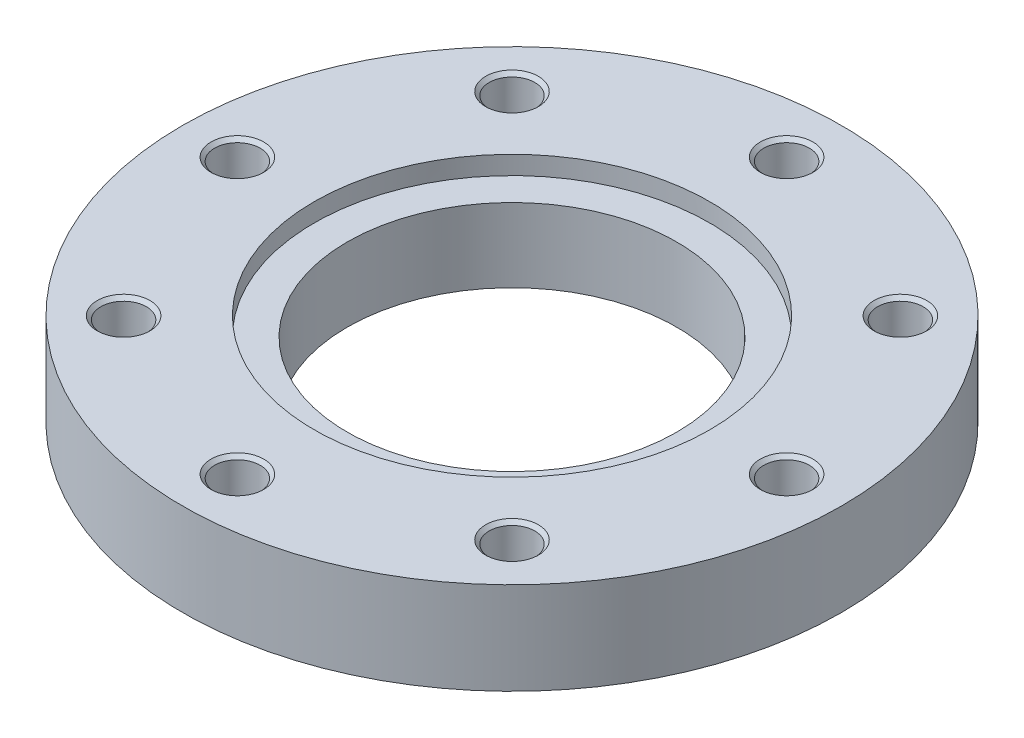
ISO-10303-21;
HEADER;
FILE_DESCRIPTION(('STEP AP214'),'2;1');
FILE_NAME('part.step','',(''),(''),'','','');
FILE_SCHEMA(('AUTOMOTIVE_DESIGN { 1 0 10303 214 1 1 1 1 }'));
ENDSEC;
DATA;
#1=APPLICATION_CONTEXT('core data for automotive mechanical design processes');
#2=APPLICATION_PROTOCOL_DEFINITION('international standard','automotive_design',2000,#1);
#3=PRODUCT_CONTEXT('',#1,'mechanical');
#4=PRODUCT('Part','Part','',(#3));
#5=PRODUCT_RELATED_PRODUCT_CATEGORY('part','',(#4));
#6=PRODUCT_DEFINITION_FORMATION('','',#4);
#7=PRODUCT_DEFINITION_CONTEXT('part definition',#1,'design');
#8=PRODUCT_DEFINITION('design','',#6,#7);
#9=PRODUCT_DEFINITION_SHAPE('','',#8);
#10=(LENGTH_UNIT() NAMED_UNIT(*) SI_UNIT(.MILLI.,.METRE.));
#11=(NAMED_UNIT(*) PLANE_ANGLE_UNIT() SI_UNIT($,.RADIAN.));
#12=(NAMED_UNIT(*) SI_UNIT($,.STERADIAN.) SOLID_ANGLE_UNIT());
#13=UNCERTAINTY_MEASURE_WITH_UNIT(LENGTH_MEASURE(1.E-05),#10,'distance_accuracy_value','');
#14=(GEOMETRIC_REPRESENTATION_CONTEXT(3) GLOBAL_UNCERTAINTY_ASSIGNED_CONTEXT((#13)) GLOBAL_UNIT_ASSIGNED_CONTEXT((#10,
#11,#12)) REPRESENTATION_CONTEXT('',''));
#15=CARTESIAN_POINT('',(0.,0.,0.));
#16=DIRECTION('',(0.,0.,1.));
#17=DIRECTION('',(1.,0.,0.));
#18=AXIS2_PLACEMENT_3D('',#15,#16,#17);
#19=CARTESIAN_POINT('',(0.,21.,0.));
#20=DIRECTION('',(0.,-1.,0.));
#21=DIRECTION('',(1.,0.,0.));
#22=AXIS2_PLACEMENT_3D('',#19,#20,#21);
#23=CYLINDRICAL_SURFACE('',#22,150.);
#24=CARTESIAN_POINT('',(0.,0.,0.));
#25=DIRECTION('',(0.,1.,0.));
#26=DIRECTION('',(1.,0.,0.));
#27=AXIS2_PLACEMENT_3D('',#24,#25,#26);
#28=CIRCLE('',#27,150.);
#29=CARTESIAN_POINT('',(150.,0.,0.));
#30=VERTEX_POINT('',#29);
#31=EDGE_CURVE('E9',#30,#30,#28,.T.);
#32=ORIENTED_EDGE('',*,*,#31,.T.);
#33=EDGE_LOOP('',(#32));
#34=FACE_BOUND('',#33,.T.);
#35=CARTESIAN_POINT('',(0.,42.,0.));
#36=DIRECTION('',(0.,1.,0.));
#37=DIRECTION('',(1.,0.,0.));
#38=AXIS2_PLACEMENT_3D('',#35,#36,#37);
#39=CIRCLE('',#38,150.);
#40=CARTESIAN_POINT('',(150.,42.,0.));
#41=VERTEX_POINT('',#40);
#42=EDGE_CURVE('E205',#41,#41,#39,.T.);
#43=ORIENTED_EDGE('',*,*,#42,.F.);
#44=EDGE_LOOP('',(#43));
#45=FACE_BOUND('',#44,.T.);
#46=ADVANCED_FACE('F15',(#34,#45),#23,.T.);
#47=CARTESIAN_POINT('',(112.5,0.,0.));
#48=DIRECTION('',(0.,-1.,0.));
#49=DIRECTION('',(-1.,0.,0.));
#50=AXIS2_PLACEMENT_3D('',#47,#48,#49);
#51=PLANE('',#50);
#52=CARTESIAN_POINT('',(0.,0.,0.));
#53=DIRECTION('',(0.,1.,0.));
#54=DIRECTION('',(1.,0.,0.));
#55=AXIS2_PLACEMENT_3D('',#52,#53,#54);
#56=CIRCLE('',#55,75.);
#57=CARTESIAN_POINT('',(75.,0.,0.));
#58=VERTEX_POINT('',#57);
#59=EDGE_CURVE('E19',#58,#58,#56,.T.);
#60=ORIENTED_EDGE('',*,*,#59,.T.);
#61=EDGE_LOOP('',(#60));
#62=FACE_BOUND('',#61,.T.);
#63=ORIENTED_EDGE('',*,*,#31,.F.);
#64=EDGE_LOOP('',(#63));
#65=FACE_BOUND('',#64,.T.);
#66=ADVANCED_FACE('F17',(#62,#65),#51,.T.);
#67=CARTESIAN_POINT('',(0.,21.,0.));
#68=DIRECTION('',(0.,-1.,0.));
#69=DIRECTION('',(1.,0.,0.));
#70=AXIS2_PLACEMENT_3D('',#67,#68,#69);
#71=CYLINDRICAL_SURFACE('',#70,75.);
#72=ORIENTED_EDGE('',*,*,#59,.F.);
#73=EDGE_LOOP('',(#72));
#74=FACE_BOUND('',#73,.T.);
#75=CARTESIAN_POINT('',(0.,33.6,0.));
#76=DIRECTION('',(0.,1.,0.));
#77=DIRECTION('',(1.,0.,0.));
#78=AXIS2_PLACEMENT_3D('',#75,#76,#77);
#79=CIRCLE('',#78,75.);
#80=CARTESIAN_POINT('',(-75.,33.6,0.));
#81=VERTEX_POINT('',#80);
#82=EDGE_CURVE('E86',#81,#81,#79,.T.);
#83=ORIENTED_EDGE('',*,*,#82,.T.);
#84=EDGE_LOOP('',(#83));
#85=FACE_BOUND('',#84,.T.);
#86=ADVANCED_FACE('F212',(#74,#85),#71,.F.);
#87=CARTESIAN_POINT('',(112.5,42.,0.));
#88=DIRECTION('',(0.,1.,0.));
#89=DIRECTION('',(1.,0.,0.));
#90=AXIS2_PLACEMENT_3D('',#87,#88,#89);
#91=PLANE('',#90);
#92=ORIENTED_EDGE('',*,*,#42,.T.);
#93=EDGE_LOOP('',(#92));
#94=FACE_BOUND('',#93,.T.);
#95=CARTESIAN_POINT('',(0.,42.,0.));
#96=DIRECTION('',(0.,-1.,0.));
#97=DIRECTION('',(1.,0.,0.));
#98=AXIS2_PLACEMENT_3D('',#95,#96,#97);
#99=CIRCLE('',#98,90.);
#100=CARTESIAN_POINT('',(-90.,42.,0.));
#101=VERTEX_POINT('',#100);
#102=EDGE_CURVE('E181',#101,#101,#99,.T.);
#103=ORIENTED_EDGE('',*,*,#102,.T.);
#104=EDGE_LOOP('',(#103));
#105=FACE_BOUND('',#104,.T.);
#106=CARTESIAN_POINT('',(125.,42.,0.));
#107=DIRECTION('',(0.,-1.,0.));
#108=DIRECTION('',(1.,0.,0.));
#109=AXIS2_PLACEMENT_3D('',#106,#107,#108);
#110=CIRCLE('',#109,12.);
#111=CARTESIAN_POINT('',(137.,42.,0.));
#112=VERTEX_POINT('',#111);
#113=EDGE_CURVE('E195',#112,#112,#110,.T.);
#114=ORIENTED_EDGE('',*,*,#113,.T.);
#115=EDGE_LOOP('',(#114));
#116=FACE_BOUND('',#115,.T.);
#117=CARTESIAN_POINT('',(88.3883476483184,42.,-88.3883476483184));
#118=DIRECTION('',(0.,-1.,0.));
#119=DIRECTION('',(0.707106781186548,0.,-0.707106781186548));
#120=AXIS2_PLACEMENT_3D('',#117,#118,#119);
#121=CIRCLE('',#120,12.);
#122=CARTESIAN_POINT('',(96.873629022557,42.,-96.873629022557));
#123=VERTEX_POINT('',#122);
#124=EDGE_CURVE('E175',#123,#123,#121,.T.);
#125=ORIENTED_EDGE('',*,*,#124,.T.);
#126=EDGE_LOOP('',(#125));
#127=FACE_BOUND('',#126,.T.);
#128=CARTESIAN_POINT('',(0.,42.,-125.));
#129=DIRECTION('',(0.,-1.,0.));
#130=DIRECTION('',(0.,0.,-1.));
#131=AXIS2_PLACEMENT_3D('',#128,#129,#130);
#132=CIRCLE('',#131,12.);
#133=CARTESIAN_POINT('',(0.,42.,-137.));
#134=VERTEX_POINT('',#133);
#135=EDGE_CURVE('E373',#134,#134,#132,.T.);
#136=ORIENTED_EDGE('',*,*,#135,.T.);
#137=EDGE_LOOP('',(#136));
#138=FACE_BOUND('',#137,.T.);
#139=CARTESIAN_POINT('',(-88.3883476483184,42.,-88.3883476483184));
#140=DIRECTION('',(0.,-1.,0.));
#141=DIRECTION('',(-0.707106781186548,0.,-0.707106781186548));
#142=AXIS2_PLACEMENT_3D('',#139,#140,#141);
#143=CIRCLE('',#142,12.);
#144=CARTESIAN_POINT('',(-96.873629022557,42.,-96.873629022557));
#145=VERTEX_POINT('',#144);
#146=EDGE_CURVE('E376',#145,#145,#143,.T.);
#147=ORIENTED_EDGE('',*,*,#146,.T.);
#148=EDGE_LOOP('',(#147));
#149=FACE_BOUND('',#148,.T.);
#150=CARTESIAN_POINT('',(-125.,42.,0.));
#151=DIRECTION('',(0.,-1.,0.));
#152=DIRECTION('',(-1.,0.,0.));
#153=AXIS2_PLACEMENT_3D('',#150,#151,#152);
#154=CIRCLE('',#153,12.);
#155=CARTESIAN_POINT('',(-137.,42.,0.));
#156=VERTEX_POINT('',#155);
#157=EDGE_CURVE('E379',#156,#156,#154,.T.);
#158=ORIENTED_EDGE('',*,*,#157,.T.);
#159=EDGE_LOOP('',(#158));
#160=FACE_BOUND('',#159,.T.);
#161=CARTESIAN_POINT('',(-88.3883476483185,42.,88.3883476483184));
#162=DIRECTION('',(0.,-1.,0.));
#163=DIRECTION('',(-0.707106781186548,0.,0.707106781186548));
#164=AXIS2_PLACEMENT_3D('',#161,#162,#163);
#165=CIRCLE('',#164,12.);
#166=CARTESIAN_POINT('',(-96.873629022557,42.,96.873629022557));
#167=VERTEX_POINT('',#166);
#168=EDGE_CURVE('E384',#167,#167,#165,.T.);
#169=ORIENTED_EDGE('',*,*,#168,.T.);
#170=EDGE_LOOP('',(#169));
#171=FACE_BOUND('',#170,.T.);
#172=CARTESIAN_POINT('',(0.,42.,125.));
#173=DIRECTION('',(0.,-1.,0.));
#174=DIRECTION('',(0.,0.,1.));
#175=AXIS2_PLACEMENT_3D('',#172,#173,#174);
#176=CIRCLE('',#175,12.);
#177=CARTESIAN_POINT('',(0.,42.,137.));
#178=VERTEX_POINT('',#177);
#179=EDGE_CURVE('E389',#178,#178,#176,.T.);
#180=ORIENTED_EDGE('',*,*,#179,.T.);
#181=EDGE_LOOP('',(#180));
#182=FACE_BOUND('',#181,.T.);
#183=CARTESIAN_POINT('',(88.3883476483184,42.,88.3883476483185));
#184=DIRECTION('',(0.,-1.,0.));
#185=DIRECTION('',(0.707106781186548,0.,0.707106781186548));
#186=AXIS2_PLACEMENT_3D('',#183,#184,#185);
#187=CIRCLE('',#186,12.);
#188=CARTESIAN_POINT('',(96.873629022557,42.,96.873629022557));
#189=VERTEX_POINT('',#188);
#190=EDGE_CURVE('E393',#189,#189,#187,.T.);
#191=ORIENTED_EDGE('',*,*,#190,.T.);
#192=EDGE_LOOP('',(#191));
#193=FACE_BOUND('',#192,.T.);
#194=ADVANCED_FACE('F214',(#94,#105,#116,#127,#138,#149,#160,#171,#182,#193),#91,.T.);
#195=CARTESIAN_POINT('',(0.,33.6,0.));
#196=DIRECTION('',(0.,-1.,0.));
#197=DIRECTION('',(-1.,0.,0.));
#198=AXIS2_PLACEMENT_3D('',#195,#196,#197);
#199=PLANE('',#198);
#200=CARTESIAN_POINT('',(0.,33.6,0.));
#201=DIRECTION('',(0.,-1.,0.));
#202=DIRECTION('',(1.,0.,0.));
#203=AXIS2_PLACEMENT_3D('',#200,#201,#202);
#204=CIRCLE('',#203,90.);
#205=CARTESIAN_POINT('',(90.,33.6,0.));
#206=VERTEX_POINT('',#205);
#207=EDGE_CURVE('E81',#206,#206,#204,.T.);
#208=ORIENTED_EDGE('',*,*,#207,.F.);
#209=EDGE_LOOP('',(#208));
#210=FACE_BOUND('',#209,.T.);
#211=ORIENTED_EDGE('',*,*,#82,.F.);
#212=EDGE_LOOP('',(#211));
#213=FACE_BOUND('',#212,.T.);
#214=ADVANCED_FACE('F221',(#210,#213),#199,.F.);
#215=CARTESIAN_POINT('',(0.,39.9,0.));
#216=DIRECTION('',(0.,-1.,0.));
#217=DIRECTION('',(1.,0.,0.));
#218=AXIS2_PLACEMENT_3D('',#215,#216,#217);
#219=CYLINDRICAL_SURFACE('',#218,90.);
#220=ORIENTED_EDGE('',*,*,#207,.T.);
#221=EDGE_LOOP('',(#220));
#222=FACE_BOUND('',#221,.T.);
#223=ORIENTED_EDGE('',*,*,#102,.F.);
#224=EDGE_LOOP('',(#223));
#225=FACE_BOUND('',#224,.T.);
#226=ADVANCED_FACE('F355',(#222,#225),#219,.F.);
#227=CARTESIAN_POINT('',(125.,6.00463463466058,0.));
#228=DIRECTION('',(0.,1.,0.));
#229=DIRECTION('',(1.,0.,0.));
#230=AXIS2_PLACEMENT_3D('',#227,#228,#229);
#231=CONICAL_SURFACE('',#230,5.188125,1.0471975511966);
#232=CARTESIAN_POINT('',(125.,9.,0.));
#233=DIRECTION('',(0.,-1.,0.));
#234=DIRECTION('',(1.,0.,0.));
#235=AXIS2_PLACEMENT_3D('',#232,#233,#234);
#236=CIRCLE('',#235,10.37625);
#237=CARTESIAN_POINT('',(135.37625,9.,0.));
#238=VERTEX_POINT('',#237);
#239=EDGE_CURVE('E183',#238,#238,#236,.T.);
#240=ORIENTED_EDGE('',*,*,#239,.F.);
#241=EDGE_LOOP('',(#240));
#242=FACE_BOUND('',#241,.T.);
#243=CARTESIAN_POINT('',(125.,3.00926926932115,0.));
#244=VERTEX_POINT('',#243);
#245=VERTEX_LOOP('',#244);
#246=FACE_BOUND('',#245,.T.);
#247=ADVANCED_FACE('F351',(#242,#246),#231,.F.);
#248=CARTESIAN_POINT('',(125.,12.688125,0.));
#249=DIRECTION('',(0.,1.,0.));
#250=DIRECTION('',(1.,0.,0.));
#251=AXIS2_PLACEMENT_3D('',#248,#249,#250);
#252=CYLINDRICAL_SURFACE('',#251,10.37625);
#253=CARTESIAN_POINT('',(125.,16.37625,0.));
#254=DIRECTION('',(0.,-1.,0.));
#255=DIRECTION('',(1.,0.,0.));
#256=AXIS2_PLACEMENT_3D('',#253,#254,#255);
#257=CIRCLE('',#256,10.37625);
#258=CARTESIAN_POINT('',(135.37625,16.37625,0.));
#259=VERTEX_POINT('',#258);
#260=EDGE_CURVE('E202',#259,#259,#257,.T.);
#261=ORIENTED_EDGE('',*,*,#260,.F.);
#262=EDGE_LOOP('',(#261));
#263=FACE_BOUND('',#262,.T.);
#264=ORIENTED_EDGE('',*,*,#239,.T.);
#265=EDGE_LOOP('',(#264));
#266=FACE_BOUND('',#265,.T.);
#267=ADVANCED_FACE('F347',(#263,#266),#252,.F.);
#268=CARTESIAN_POINT('',(125.,17.188125,0.));
#269=DIRECTION('',(0.,1.,0.));
#270=DIRECTION('',(1.,0.,0.));
#271=AXIS2_PLACEMENT_3D('',#268,#269,#270);
#272=CONICAL_SURFACE('',#271,11.188125,0.785398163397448);
#273=CARTESIAN_POINT('',(125.,18.,0.));
#274=DIRECTION('',(0.,-1.,0.));
#275=DIRECTION('',(1.,0.,0.));
#276=AXIS2_PLACEMENT_3D('',#273,#274,#275);
#277=CIRCLE('',#276,12.);
#278=CARTESIAN_POINT('',(137.,18.,0.));
#279=VERTEX_POINT('',#278);
#280=EDGE_CURVE('E200',#279,#279,#277,.T.);
#281=ORIENTED_EDGE('',*,*,#280,.F.);
#282=EDGE_LOOP('',(#281));
#283=FACE_BOUND('',#282,.T.);
#284=ORIENTED_EDGE('',*,*,#260,.T.);
#285=EDGE_LOOP('',(#284));
#286=FACE_BOUND('',#285,.T.);
#287=ADVANCED_FACE('F343',(#283,#286),#272,.F.);
#288=CARTESIAN_POINT('',(136.188125,18.,0.));
#289=DIRECTION('',(0.,1.,0.));
#290=DIRECTION('',(-1.,0.,0.));
#291=AXIS2_PLACEMENT_3D('',#288,#289,#290);
#292=PLANE('',#291);
#293=CARTESIAN_POINT('',(125.,18.,0.));
#294=DIRECTION('',(0.,-1.,0.));
#295=DIRECTION('',(1.,0.,0.));
#296=AXIS2_PLACEMENT_3D('',#293,#294,#295);
#297=CIRCLE('',#296,10.37625);
#298=CARTESIAN_POINT('',(135.37625,18.,0.));
#299=VERTEX_POINT('',#298);
#300=EDGE_CURVE('E198',#299,#299,#297,.T.);
#301=ORIENTED_EDGE('',*,*,#300,.F.);
#302=EDGE_LOOP('',(#301));
#303=FACE_BOUND('',#302,.T.);
#304=ORIENTED_EDGE('',*,*,#280,.T.);
#305=EDGE_LOOP('',(#304));
#306=FACE_BOUND('',#305,.T.);
#307=ADVANCED_FACE('F340',(#303,#306),#292,.F.);
#308=CARTESIAN_POINT('',(125.,29.188125,0.));
#309=DIRECTION('',(0.,1.,0.));
#310=DIRECTION('',(1.,0.,0.));
#311=AXIS2_PLACEMENT_3D('',#308,#309,#310);
#312=CYLINDRICAL_SURFACE('',#311,10.37625);
#313=CARTESIAN_POINT('',(125.,40.37625,0.));
#314=DIRECTION('',(0.,-1.,0.));
#315=DIRECTION('',(1.,0.,0.));
#316=AXIS2_PLACEMENT_3D('',#313,#314,#315);
#317=CIRCLE('',#316,10.37625);
#318=CARTESIAN_POINT('',(135.37625,40.37625,0.));
#319=VERTEX_POINT('',#318);
#320=EDGE_CURVE('E193',#319,#319,#317,.T.);
#321=ORIENTED_EDGE('',*,*,#320,.F.);
#322=EDGE_LOOP('',(#321));
#323=FACE_BOUND('',#322,.T.);
#324=ORIENTED_EDGE('',*,*,#300,.T.);
#325=EDGE_LOOP('',(#324));
#326=FACE_BOUND('',#325,.T.);
#327=ADVANCED_FACE('F266',(#323,#326),#312,.F.);
#328=CARTESIAN_POINT('',(125.,41.188125,0.));
#329=DIRECTION('',(0.,1.,0.));
#330=DIRECTION('',(1.,0.,0.));
#331=AXIS2_PLACEMENT_3D('',#328,#329,#330);
#332=CONICAL_SURFACE('',#331,11.188125,0.785398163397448);
#333=ORIENTED_EDGE('',*,*,#113,.F.);
#334=EDGE_LOOP('',(#333));
#335=FACE_BOUND('',#334,.T.);
#336=ORIENTED_EDGE('',*,*,#320,.T.);
#337=EDGE_LOOP('',(#336));
#338=FACE_BOUND('',#337,.T.);
#339=ADVANCED_FACE('F262',(#335,#338),#332,.F.);
#340=CARTESIAN_POINT('',(88.3883476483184,6.00463463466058,-88.3883476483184));
#341=DIRECTION('',(0.,1.,0.));
#342=DIRECTION('',(0.707106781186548,0.,-0.707106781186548));
#343=AXIS2_PLACEMENT_3D('',#340,#341,#342);
#344=CONICAL_SURFACE('',#343,5.188125,1.0471975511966);
#345=CARTESIAN_POINT('',(88.3883476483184,9.,-88.3883476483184));
#346=DIRECTION('',(0.,-1.,0.));
#347=DIRECTION('',(0.707106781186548,0.,-0.707106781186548));
#348=AXIS2_PLACEMENT_3D('',#345,#346,#347);
#349=CIRCLE('',#348,10.37625);
#350=CARTESIAN_POINT('',(95.7254643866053,9.,-95.7254643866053));
#351=VERTEX_POINT('',#350);
#352=EDGE_CURVE('E191',#351,#351,#349,.T.);
#353=ORIENTED_EDGE('',*,*,#352,.F.);
#354=EDGE_LOOP('',(#353));
#355=FACE_BOUND('',#354,.T.);
#356=CARTESIAN_POINT('',(88.3883476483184,3.00926926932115,-88.3883476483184));
#357=VERTEX_POINT('',#356);
#358=VERTEX_LOOP('',#357);
#359=FACE_BOUND('',#358,.T.);
#360=ADVANCED_FACE('F265',(#355,#359),#344,.F.);
#361=CARTESIAN_POINT('',(88.3883476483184,12.688125,-88.3883476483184));
#362=DIRECTION('',(0.,1.,0.));
#363=DIRECTION('',(0.707106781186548,0.,-0.707106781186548));
#364=AXIS2_PLACEMENT_3D('',#361,#362,#363);
#365=CYLINDRICAL_SURFACE('',#364,10.37625);
#366=CARTESIAN_POINT('',(88.3883476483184,16.37625,-88.3883476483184));
#367=DIRECTION('',(0.,-1.,0.));
#368=DIRECTION('',(0.707106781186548,0.,-0.707106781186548));
#369=AXIS2_PLACEMENT_3D('',#366,#367,#368);
#370=CIRCLE('',#369,10.37625);
#371=CARTESIAN_POINT('',(95.7254643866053,16.37625,-95.7254643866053));
#372=VERTEX_POINT('',#371);
#373=EDGE_CURVE('E188',#372,#372,#370,.T.);
#374=ORIENTED_EDGE('',*,*,#373,.F.);
#375=EDGE_LOOP('',(#374));
#376=FACE_BOUND('',#375,.T.);
#377=ORIENTED_EDGE('',*,*,#352,.T.);
#378=EDGE_LOOP('',(#377));
#379=FACE_BOUND('',#378,.T.);
#380=ADVANCED_FACE('F332',(#376,#379),#365,.F.);
#381=CARTESIAN_POINT('',(88.3883476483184,17.188125,-88.3883476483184));
#382=DIRECTION('',(0.,1.,0.));
#383=DIRECTION('',(0.707106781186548,0.,-0.707106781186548));
#384=AXIS2_PLACEMENT_3D('',#381,#382,#383);
#385=CONICAL_SURFACE('',#384,11.188125,0.785398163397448);
#386=CARTESIAN_POINT('',(88.3883476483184,18.,-88.3883476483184));
#387=DIRECTION('',(0.,-1.,0.));
#388=DIRECTION('',(0.707106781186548,0.,-0.707106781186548));
#389=AXIS2_PLACEMENT_3D('',#386,#387,#388);
#390=CIRCLE('',#389,12.);
#391=CARTESIAN_POINT('',(96.873629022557,18.,-96.873629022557));
#392=VERTEX_POINT('',#391);
#393=EDGE_CURVE('E186',#392,#392,#390,.T.);
#394=ORIENTED_EDGE('',*,*,#393,.F.);
#395=EDGE_LOOP('',(#394));
#396=FACE_BOUND('',#395,.T.);
#397=ORIENTED_EDGE('',*,*,#373,.T.);
#398=EDGE_LOOP('',(#397));
#399=FACE_BOUND('',#398,.T.);
#400=ADVANCED_FACE('F328',(#396,#399),#385,.F.);
#401=CARTESIAN_POINT('',(96.2995467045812,18.,-96.2995467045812));
#402=DIRECTION('',(0.,1.,0.));
#403=DIRECTION('',(-0.707106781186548,0.,0.707106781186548));
#404=AXIS2_PLACEMENT_3D('',#401,#402,#403);
#405=PLANE('',#404);
#406=CARTESIAN_POINT('',(88.3883476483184,18.,-88.3883476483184));
#407=DIRECTION('',(0.,-1.,0.));
#408=DIRECTION('',(0.707106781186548,0.,-0.707106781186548));
#409=AXIS2_PLACEMENT_3D('',#406,#407,#408);
#410=CIRCLE('',#409,10.37625);
#411=CARTESIAN_POINT('',(95.7254643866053,18.,-95.7254643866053));
#412=VERTEX_POINT('',#411);
#413=EDGE_CURVE('E185',#412,#412,#410,.T.);
#414=ORIENTED_EDGE('',*,*,#413,.F.);
#415=EDGE_LOOP('',(#414));
#416=FACE_BOUND('',#415,.T.);
#417=ORIENTED_EDGE('',*,*,#393,.T.);
#418=EDGE_LOOP('',(#417));
#419=FACE_BOUND('',#418,.T.);
#420=ADVANCED_FACE('F324',(#416,#419),#405,.F.);
#421=CARTESIAN_POINT('',(88.3883476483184,29.188125,-88.3883476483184));
#422=DIRECTION('',(0.,1.,0.));
#423=DIRECTION('',(0.707106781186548,0.,-0.707106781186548));
#424=AXIS2_PLACEMENT_3D('',#421,#422,#423);
#425=CYLINDRICAL_SURFACE('',#424,10.37625);
#426=CARTESIAN_POINT('',(88.3883476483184,40.37625,-88.3883476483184));
#427=DIRECTION('',(0.,-1.,0.));
#428=DIRECTION('',(0.707106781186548,0.,-0.707106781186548));
#429=AXIS2_PLACEMENT_3D('',#426,#427,#428);
#430=CIRCLE('',#429,10.37625);
#431=CARTESIAN_POINT('',(95.7254643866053,40.37625,-95.7254643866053));
#432=VERTEX_POINT('',#431);
#433=EDGE_CURVE('E173',#432,#432,#430,.T.);
#434=ORIENTED_EDGE('',*,*,#433,.F.);
#435=EDGE_LOOP('',(#434));
#436=FACE_BOUND('',#435,.T.);
#437=ORIENTED_EDGE('',*,*,#413,.T.);
#438=EDGE_LOOP('',(#437));
#439=FACE_BOUND('',#438,.T.);
#440=ADVANCED_FACE('F320',(#436,#439),#425,.F.);
#441=CARTESIAN_POINT('',(88.3883476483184,41.188125,-88.3883476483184));
#442=DIRECTION('',(0.,1.,0.));
#443=DIRECTION('',(0.707106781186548,0.,-0.707106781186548));
#444=AXIS2_PLACEMENT_3D('',#441,#442,#443);
#445=CONICAL_SURFACE('',#444,11.188125,0.785398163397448);
#446=ORIENTED_EDGE('',*,*,#124,.F.);
#447=EDGE_LOOP('',(#446));
#448=FACE_BOUND('',#447,.T.);
#449=ORIENTED_EDGE('',*,*,#433,.T.);
#450=EDGE_LOOP('',(#449));
#451=FACE_BOUND('',#450,.T.);
#452=ADVANCED_FACE('F317',(#448,#451),#445,.F.);
#453=CARTESIAN_POINT('',(0.,6.00463463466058,-125.));
#454=DIRECTION('',(0.,1.,0.));
#455=DIRECTION('',(0.,0.,-1.));
#456=AXIS2_PLACEMENT_3D('',#453,#454,#455);
#457=CONICAL_SURFACE('',#456,5.188125,1.0471975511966);
#458=CARTESIAN_POINT('',(0.,9.,-125.));
#459=DIRECTION('',(0.,-1.,0.));
#460=DIRECTION('',(0.,0.,-1.));
#461=AXIS2_PLACEMENT_3D('',#458,#459,#460);
#462=CIRCLE('',#461,10.37625);
#463=CARTESIAN_POINT('',(0.,9.,-135.37625));
#464=VERTEX_POINT('',#463);
#465=EDGE_CURVE('E170',#464,#464,#462,.T.);
#466=ORIENTED_EDGE('',*,*,#465,.F.);
#467=EDGE_LOOP('',(#466));
#468=FACE_BOUND('',#467,.T.);
#469=CARTESIAN_POINT('',(0.,3.00926926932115,-125.));
#470=VERTEX_POINT('',#469);
#471=VERTEX_LOOP('',#470);
#472=FACE_BOUND('',#471,.T.);
#473=ADVANCED_FACE('F313',(#468,#472),#457,.F.);
#474=CARTESIAN_POINT('',(0.,12.688125,-125.));
#475=DIRECTION('',(0.,1.,0.));
#476=DIRECTION('',(0.,0.,-1.));
#477=AXIS2_PLACEMENT_3D('',#474,#475,#476);
#478=CYLINDRICAL_SURFACE('',#477,10.37625);
#479=CARTESIAN_POINT('',(0.,16.37625,-125.));
#480=DIRECTION('',(0.,-1.,0.));
#481=DIRECTION('',(0.,0.,-1.));
#482=AXIS2_PLACEMENT_3D('',#479,#480,#481);
#483=CIRCLE('',#482,10.37625);
#484=CARTESIAN_POINT('',(0.,16.37625,-135.37625));
#485=VERTEX_POINT('',#484);
#486=EDGE_CURVE('E166',#485,#485,#483,.T.);
#487=ORIENTED_EDGE('',*,*,#486,.F.);
#488=EDGE_LOOP('',(#487));
#489=FACE_BOUND('',#488,.T.);
#490=ORIENTED_EDGE('',*,*,#465,.T.);
#491=EDGE_LOOP('',(#490));
#492=FACE_BOUND('',#491,.T.);
#493=ADVANCED_FACE('F171',(#489,#492),#478,.F.);
#494=CARTESIAN_POINT('',(0.,17.188125,-125.));
#495=DIRECTION('',(0.,1.,0.));
#496=DIRECTION('',(0.,0.,-1.));
#497=AXIS2_PLACEMENT_3D('',#494,#495,#496);
#498=CONICAL_SURFACE('',#497,11.188125,0.785398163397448);
#499=CARTESIAN_POINT('',(0.,18.,-125.));
#500=DIRECTION('',(0.,-1.,0.));
#501=DIRECTION('',(0.,0.,-1.));
#502=AXIS2_PLACEMENT_3D('',#499,#500,#501);
#503=CIRCLE('',#502,12.);
#504=CARTESIAN_POINT('',(0.,18.,-137.));
#505=VERTEX_POINT('',#504);
#506=EDGE_CURVE('E177',#505,#505,#503,.T.);
#507=ORIENTED_EDGE('',*,*,#506,.F.);
#508=EDGE_LOOP('',(#507));
#509=FACE_BOUND('',#508,.T.);
#510=ORIENTED_EDGE('',*,*,#486,.T.);
#511=EDGE_LOOP('',(#510));
#512=FACE_BOUND('',#511,.T.);
#513=ADVANCED_FACE('F306',(#509,#512),#498,.F.);
#514=CARTESIAN_POINT('',(0.,18.,-136.188125));
#515=DIRECTION('',(0.,1.,0.));
#516=DIRECTION('',(0.,0.,1.));
#517=AXIS2_PLACEMENT_3D('',#514,#515,#516);
#518=PLANE('',#517);
#519=CARTESIAN_POINT('',(0.,18.,-125.));
#520=DIRECTION('',(0.,-1.,0.));
#521=DIRECTION('',(0.,0.,-1.));
#522=AXIS2_PLACEMENT_3D('',#519,#520,#521);
#523=CIRCLE('',#522,10.37625);
#524=CARTESIAN_POINT('',(0.,18.,-135.37625));
#525=VERTEX_POINT('',#524);
#526=EDGE_CURVE('E467',#525,#525,#523,.T.);
#527=ORIENTED_EDGE('',*,*,#526,.F.);
#528=EDGE_LOOP('',(#527));
#529=FACE_BOUND('',#528,.T.);
#530=ORIENTED_EDGE('',*,*,#506,.T.);
#531=EDGE_LOOP('',(#530));
#532=FACE_BOUND('',#531,.T.);
#533=ADVANCED_FACE('F302',(#529,#532),#518,.F.);
#534=CARTESIAN_POINT('',(0.,29.188125,-125.));
#535=DIRECTION('',(0.,1.,0.));
#536=DIRECTION('',(0.,0.,-1.));
#537=AXIS2_PLACEMENT_3D('',#534,#535,#536);
#538=CYLINDRICAL_SURFACE('',#537,10.37625);
#539=CARTESIAN_POINT('',(0.,40.37625,-125.));
#540=DIRECTION('',(0.,-1.,0.));
#541=DIRECTION('',(0.,0.,-1.));
#542=AXIS2_PLACEMENT_3D('',#539,#540,#541);
#543=CIRCLE('',#542,10.37625);
#544=CARTESIAN_POINT('',(0.,40.37625,-135.37625));
#545=VERTEX_POINT('',#544);
#546=EDGE_CURVE('E464',#545,#545,#543,.T.);
#547=ORIENTED_EDGE('',*,*,#546,.F.);
#548=EDGE_LOOP('',(#547));
#549=FACE_BOUND('',#548,.T.);
#550=ORIENTED_EDGE('',*,*,#526,.T.);
#551=EDGE_LOOP('',(#550));
#552=FACE_BOUND('',#551,.T.);
#553=ADVANCED_FACE('F298',(#549,#552),#538,.F.);
#554=CARTESIAN_POINT('',(0.,41.188125,-125.));
#555=DIRECTION('',(0.,1.,0.));
#556=DIRECTION('',(0.,0.,-1.));
#557=AXIS2_PLACEMENT_3D('',#554,#555,#556);
#558=CONICAL_SURFACE('',#557,11.188125,0.785398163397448);
#559=ORIENTED_EDGE('',*,*,#135,.F.);
#560=EDGE_LOOP('',(#559));
#561=FACE_BOUND('',#560,.T.);
#562=ORIENTED_EDGE('',*,*,#546,.T.);
#563=EDGE_LOOP('',(#562));
#564=FACE_BOUND('',#563,.T.);
#565=ADVANCED_FACE('F294',(#561,#564),#558,.F.);
#566=CARTESIAN_POINT('',(-88.3883476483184,6.00463463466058,-88.3883476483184));
#567=DIRECTION('',(0.,1.,0.));
#568=DIRECTION('',(-0.707106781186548,0.,-0.707106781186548));
#569=AXIS2_PLACEMENT_3D('',#566,#567,#568);
#570=CONICAL_SURFACE('',#569,5.188125,1.0471975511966);
#571=CARTESIAN_POINT('',(-88.3883476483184,9.,-88.3883476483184));
#572=DIRECTION('',(0.,-1.,0.));
#573=DIRECTION('',(-0.707106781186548,0.,-0.707106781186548));
#574=AXIS2_PLACEMENT_3D('',#571,#572,#573);
#575=CIRCLE('',#574,10.37625);
#576=CARTESIAN_POINT('',(-95.7254643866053,9.,-95.7254643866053));
#577=VERTEX_POINT('',#576);
#578=EDGE_CURVE('E407',#577,#577,#575,.T.);
#579=ORIENTED_EDGE('',*,*,#578,.F.);
#580=EDGE_LOOP('',(#579));
#581=FACE_BOUND('',#580,.T.);
#582=CARTESIAN_POINT('',(-88.3883476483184,3.00926926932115,-88.3883476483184));
#583=VERTEX_POINT('',#582);
#584=VERTEX_LOOP('',#583);
#585=FACE_BOUND('',#584,.T.);
#586=ADVANCED_FACE('F290',(#581,#585),#570,.F.);
#587=CARTESIAN_POINT('',(-88.3883476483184,12.688125,-88.3883476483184));
#588=DIRECTION('',(0.,1.,0.));
#589=DIRECTION('',(-0.707106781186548,0.,-0.707106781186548));
#590=AXIS2_PLACEMENT_3D('',#587,#588,#589);
#591=CYLINDRICAL_SURFACE('',#590,10.37625);
#592=CARTESIAN_POINT('',(-88.3883476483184,16.37625,-88.3883476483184));
#593=DIRECTION('',(0.,-1.,0.));
#594=DIRECTION('',(-0.707106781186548,0.,-0.707106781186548));
#595=AXIS2_PLACEMENT_3D('',#592,#593,#594);
#596=CIRCLE('',#595,10.37625);
#597=CARTESIAN_POINT('',(-95.7254643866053,16.37625,-95.7254643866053));
#598=VERTEX_POINT('',#597);
#599=EDGE_CURVE('E462',#598,#598,#596,.T.);
#600=ORIENTED_EDGE('',*,*,#599,.F.);
#601=EDGE_LOOP('',(#600));
#602=FACE_BOUND('',#601,.T.);
#603=ORIENTED_EDGE('',*,*,#578,.T.);
#604=EDGE_LOOP('',(#603));
#605=FACE_BOUND('',#604,.T.);
#606=ADVANCED_FACE('F286',(#602,#605),#591,.F.);
#607=CARTESIAN_POINT('',(-88.3883476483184,17.188125,-88.3883476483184));
#608=DIRECTION('',(0.,1.,0.));
#609=DIRECTION('',(-0.707106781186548,0.,-0.707106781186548));
#610=AXIS2_PLACEMENT_3D('',#607,#608,#609);
#611=CONICAL_SURFACE('',#610,11.188125,0.785398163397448);
#612=CARTESIAN_POINT('',(-88.3883476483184,18.,-88.3883476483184));
#613=DIRECTION('',(0.,-1.,0.));
#614=DIRECTION('',(-0.707106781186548,0.,-0.707106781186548));
#615=AXIS2_PLACEMENT_3D('',#612,#613,#614);
#616=CIRCLE('',#615,12.);
#617=CARTESIAN_POINT('',(-96.873629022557,18.,-96.873629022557));
#618=VERTEX_POINT('',#617);
#619=EDGE_CURVE('E460',#618,#618,#616,.T.);
#620=ORIENTED_EDGE('',*,*,#619,.F.);
#621=EDGE_LOOP('',(#620));
#622=FACE_BOUND('',#621,.T.);
#623=ORIENTED_EDGE('',*,*,#599,.T.);
#624=EDGE_LOOP('',(#623));
#625=FACE_BOUND('',#624,.T.);
#626=ADVANCED_FACE('F282',(#622,#625),#611,.F.);
#627=CARTESIAN_POINT('',(-96.2995467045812,18.,-96.2995467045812));
#628=DIRECTION('',(0.,1.,0.));
#629=DIRECTION('',(0.707106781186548,0.,0.707106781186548));
#630=AXIS2_PLACEMENT_3D('',#627,#628,#629);
#631=PLANE('',#630);
#632=CARTESIAN_POINT('',(-88.3883476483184,18.,-88.3883476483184));
#633=DIRECTION('',(0.,-1.,0.));
#634=DIRECTION('',(-0.707106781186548,0.,-0.707106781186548));
#635=AXIS2_PLACEMENT_3D('',#632,#633,#634);
#636=CIRCLE('',#635,10.37625);
#637=CARTESIAN_POINT('',(-95.7254643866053,18.,-95.7254643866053));
#638=VERTEX_POINT('',#637);
#639=EDGE_CURVE('E458',#638,#638,#636,.T.);
#640=ORIENTED_EDGE('',*,*,#639,.F.);
#641=EDGE_LOOP('',(#640));
#642=FACE_BOUND('',#641,.T.);
#643=ORIENTED_EDGE('',*,*,#619,.T.);
#644=EDGE_LOOP('',(#643));
#645=FACE_BOUND('',#644,.T.);
#646=ADVANCED_FACE('F278',(#642,#645),#631,.F.);
#647=CARTESIAN_POINT('',(-88.3883476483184,29.188125,-88.3883476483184));
#648=DIRECTION('',(0.,1.,0.));
#649=DIRECTION('',(-0.707106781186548,0.,-0.707106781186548));
#650=AXIS2_PLACEMENT_3D('',#647,#648,#649);
#651=CYLINDRICAL_SURFACE('',#650,10.37625);
#652=CARTESIAN_POINT('',(-88.3883476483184,40.37625,-88.3883476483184));
#653=DIRECTION('',(0.,-1.,0.));
#654=DIRECTION('',(-0.707106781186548,0.,-0.707106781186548));
#655=AXIS2_PLACEMENT_3D('',#652,#653,#654);
#656=CIRCLE('',#655,10.37625);
#657=CARTESIAN_POINT('',(-95.7254643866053,40.37625,-95.7254643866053));
#658=VERTEX_POINT('',#657);
#659=EDGE_CURVE('E455',#658,#658,#656,.T.);
#660=ORIENTED_EDGE('',*,*,#659,.F.);
#661=EDGE_LOOP('',(#660));
#662=FACE_BOUND('',#661,.T.);
#663=ORIENTED_EDGE('',*,*,#639,.T.);
#664=EDGE_LOOP('',(#663));
#665=FACE_BOUND('',#664,.T.);
#666=ADVANCED_FACE('F274',(#662,#665),#651,.F.);
#667=CARTESIAN_POINT('',(-88.3883476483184,41.188125,-88.3883476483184));
#668=DIRECTION('',(0.,1.,0.));
#669=DIRECTION('',(-0.707106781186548,0.,-0.707106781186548));
#670=AXIS2_PLACEMENT_3D('',#667,#668,#669);
#671=CONICAL_SURFACE('',#670,11.188125,0.785398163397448);
#672=ORIENTED_EDGE('',*,*,#146,.F.);
#673=EDGE_LOOP('',(#672));
#674=FACE_BOUND('',#673,.T.);
#675=ORIENTED_EDGE('',*,*,#659,.T.);
#676=EDGE_LOOP('',(#675));
#677=FACE_BOUND('',#676,.T.);
#678=ADVANCED_FACE('F270',(#674,#677),#671,.F.);
#679=CARTESIAN_POINT('',(-125.,6.00463463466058,0.));
#680=DIRECTION('',(0.,1.,0.));
#681=DIRECTION('',(-1.,0.,0.));
#682=AXIS2_PLACEMENT_3D('',#679,#680,#681);
#683=CONICAL_SURFACE('',#682,5.188125,1.0471975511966);
#684=CARTESIAN_POINT('',(-125.,9.,0.));
#685=DIRECTION('',(0.,-1.,0.));
#686=DIRECTION('',(-1.,0.,0.));
#687=AXIS2_PLACEMENT_3D('',#684,#685,#686);
#688=CIRCLE('',#687,10.37625);
#689=CARTESIAN_POINT('',(-135.37625,9.,0.));
#690=VERTEX_POINT('',#689);
#691=EDGE_CURVE('E453',#690,#690,#688,.T.);
#692=ORIENTED_EDGE('',*,*,#691,.F.);
#693=EDGE_LOOP('',(#692));
#694=FACE_BOUND('',#693,.T.);
#695=CARTESIAN_POINT('',(-125.,3.00926926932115,0.));
#696=VERTEX_POINT('',#695);
#697=VERTEX_LOOP('',#696);
#698=FACE_BOUND('',#697,.T.);
#699=ADVANCED_FACE('F260',(#694,#698),#683,.F.);
#700=CARTESIAN_POINT('',(-125.,12.688125,0.));
#701=DIRECTION('',(0.,1.,0.));
#702=DIRECTION('',(-1.,0.,0.));
#703=AXIS2_PLACEMENT_3D('',#700,#701,#702);
#704=CYLINDRICAL_SURFACE('',#703,10.37625);
#705=CARTESIAN_POINT('',(-125.,16.37625,0.));
#706=DIRECTION('',(0.,-1.,0.));
#707=DIRECTION('',(-1.,0.,0.));
#708=AXIS2_PLACEMENT_3D('',#705,#706,#707);
#709=CIRCLE('',#708,10.37625);
#710=CARTESIAN_POINT('',(-135.37625,16.37625,0.));
#711=VERTEX_POINT('',#710);
#712=EDGE_CURVE('E451',#711,#711,#709,.T.);
#713=ORIENTED_EDGE('',*,*,#712,.F.);
#714=EDGE_LOOP('',(#713));
#715=FACE_BOUND('',#714,.T.);
#716=ORIENTED_EDGE('',*,*,#691,.T.);
#717=EDGE_LOOP('',(#716));
#718=FACE_BOUND('',#717,.T.);
#719=ADVANCED_FACE('F256',(#715,#718),#704,.F.);
#720=CARTESIAN_POINT('',(-125.,17.188125,0.));
#721=DIRECTION('',(0.,1.,0.));
#722=DIRECTION('',(-1.,0.,0.));
#723=AXIS2_PLACEMENT_3D('',#720,#721,#722);
#724=CONICAL_SURFACE('',#723,11.188125,0.785398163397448);
#725=CARTESIAN_POINT('',(-125.,18.,0.));
#726=DIRECTION('',(0.,-1.,0.));
#727=DIRECTION('',(-1.,0.,0.));
#728=AXIS2_PLACEMENT_3D('',#725,#726,#727);
#729=CIRCLE('',#728,12.);
#730=CARTESIAN_POINT('',(-137.,18.,0.));
#731=VERTEX_POINT('',#730);
#732=EDGE_CURVE('E449',#731,#731,#729,.T.);
#733=ORIENTED_EDGE('',*,*,#732,.F.);
#734=EDGE_LOOP('',(#733));
#735=FACE_BOUND('',#734,.T.);
#736=ORIENTED_EDGE('',*,*,#712,.T.);
#737=EDGE_LOOP('',(#736));
#738=FACE_BOUND('',#737,.T.);
#739=ADVANCED_FACE('F252',(#735,#738),#724,.F.);
#740=CARTESIAN_POINT('',(-136.188125,18.,0.));
#741=DIRECTION('',(0.,1.,0.));
#742=DIRECTION('',(1.,0.,0.));
#743=AXIS2_PLACEMENT_3D('',#740,#741,#742);
#744=PLANE('',#743);
#745=CARTESIAN_POINT('',(-125.,18.,0.));
#746=DIRECTION('',(0.,-1.,0.));
#747=DIRECTION('',(-1.,0.,0.));
#748=AXIS2_PLACEMENT_3D('',#745,#746,#747);
#749=CIRCLE('',#748,10.37625);
#750=CARTESIAN_POINT('',(-135.37625,18.,0.));
#751=VERTEX_POINT('',#750);
#752=EDGE_CURVE('E447',#751,#751,#749,.T.);
#753=ORIENTED_EDGE('',*,*,#752,.F.);
#754=EDGE_LOOP('',(#753));
#755=FACE_BOUND('',#754,.T.);
#756=ORIENTED_EDGE('',*,*,#732,.T.);
#757=EDGE_LOOP('',(#756));
#758=FACE_BOUND('',#757,.T.);
#759=ADVANCED_FACE('F248',(#755,#758),#744,.F.);
#760=CARTESIAN_POINT('',(-125.,29.188125,0.));
#761=DIRECTION('',(0.,1.,0.));
#762=DIRECTION('',(-1.,0.,0.));
#763=AXIS2_PLACEMENT_3D('',#760,#761,#762);
#764=CYLINDRICAL_SURFACE('',#763,10.37625);
#765=CARTESIAN_POINT('',(-125.,40.37625,0.));
#766=DIRECTION('',(0.,-1.,0.));
#767=DIRECTION('',(-1.,0.,0.));
#768=AXIS2_PLACEMENT_3D('',#765,#766,#767);
#769=CIRCLE('',#768,10.37625);
#770=CARTESIAN_POINT('',(-135.37625,40.37625,0.));
#771=VERTEX_POINT('',#770);
#772=EDGE_CURVE('E444',#771,#771,#769,.T.);
#773=ORIENTED_EDGE('',*,*,#772,.F.);
#774=EDGE_LOOP('',(#773));
#775=FACE_BOUND('',#774,.T.);
#776=ORIENTED_EDGE('',*,*,#752,.T.);
#777=EDGE_LOOP('',(#776));
#778=FACE_BOUND('',#777,.T.);
#779=ADVANCED_FACE('F244',(#775,#778),#764,.F.);
#780=CARTESIAN_POINT('',(-125.,41.188125,0.));
#781=DIRECTION('',(0.,1.,0.));
#782=DIRECTION('',(-1.,0.,0.));
#783=AXIS2_PLACEMENT_3D('',#780,#781,#782);
#784=CONICAL_SURFACE('',#783,11.188125,0.785398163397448);
#785=ORIENTED_EDGE('',*,*,#157,.F.);
#786=EDGE_LOOP('',(#785));
#787=FACE_BOUND('',#786,.T.);
#788=ORIENTED_EDGE('',*,*,#772,.T.);
#789=EDGE_LOOP('',(#788));
#790=FACE_BOUND('',#789,.T.);
#791=ADVANCED_FACE('F240',(#787,#790),#784,.F.);
#792=CARTESIAN_POINT('',(-88.3883476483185,6.00463463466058,88.3883476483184));
#793=DIRECTION('',(0.,1.,0.));
#794=DIRECTION('',(-0.707106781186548,0.,0.707106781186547));
#795=AXIS2_PLACEMENT_3D('',#792,#793,#794);
#796=CONICAL_SURFACE('',#795,5.188125,1.0471975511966);
#797=CARTESIAN_POINT('',(-88.3883476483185,9.,88.3883476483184));
#798=DIRECTION('',(0.,-1.,0.));
#799=DIRECTION('',(-0.707106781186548,0.,0.707106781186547));
#800=AXIS2_PLACEMENT_3D('',#797,#798,#799);
#801=CIRCLE('',#800,10.37625);
#802=CARTESIAN_POINT('',(-95.7254643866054,9.,95.7254643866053));
#803=VERTEX_POINT('',#802);
#804=EDGE_CURVE('E442',#803,#803,#801,.T.);
#805=ORIENTED_EDGE('',*,*,#804,.F.);
#806=EDGE_LOOP('',(#805));
#807=FACE_BOUND('',#806,.T.);
#808=CARTESIAN_POINT('',(-88.3883476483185,3.00926926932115,88.3883476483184));
#809=VERTEX_POINT('',#808);
#810=VERTEX_LOOP('',#809);
#811=FACE_BOUND('',#810,.T.);
#812=ADVANCED_FACE('F236',(#807,#811),#796,.F.);
#813=CARTESIAN_POINT('',(-88.3883476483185,12.688125,88.3883476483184));
#814=DIRECTION('',(0.,1.,0.));
#815=DIRECTION('',(-0.707106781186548,0.,0.707106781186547));
#816=AXIS2_PLACEMENT_3D('',#813,#814,#815);
#817=CYLINDRICAL_SURFACE('',#816,10.37625);
#818=CARTESIAN_POINT('',(-88.3883476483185,16.37625,88.3883476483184));
#819=DIRECTION('',(0.,-1.,0.));
#820=DIRECTION('',(-0.707106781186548,0.,0.707106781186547));
#821=AXIS2_PLACEMENT_3D('',#818,#819,#820);
#822=CIRCLE('',#821,10.37625);
#823=CARTESIAN_POINT('',(-95.7254643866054,16.37625,95.7254643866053));
#824=VERTEX_POINT('',#823);
#825=EDGE_CURVE('E439',#824,#824,#822,.T.);
#826=ORIENTED_EDGE('',*,*,#825,.F.);
#827=EDGE_LOOP('',(#826));
#828=FACE_BOUND('',#827,.T.);
#829=ORIENTED_EDGE('',*,*,#804,.T.);
#830=EDGE_LOOP('',(#829));
#831=FACE_BOUND('',#830,.T.);
#832=ADVANCED_FACE('F233',(#828,#831),#817,.F.);
#833=CARTESIAN_POINT('',(-88.3883476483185,17.188125,88.3883476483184));
#834=DIRECTION('',(0.,1.,0.));
#835=DIRECTION('',(-0.707106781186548,0.,0.707106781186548));
#836=AXIS2_PLACEMENT_3D('',#833,#834,#835);
#837=CONICAL_SURFACE('',#836,11.188125,0.785398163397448);
#838=CARTESIAN_POINT('',(-88.3883476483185,18.,88.3883476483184));
#839=DIRECTION('',(0.,-1.,0.));
#840=DIRECTION('',(-0.707106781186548,0.,0.707106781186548));
#841=AXIS2_PLACEMENT_3D('',#838,#839,#840);
#842=CIRCLE('',#841,12.);
#843=CARTESIAN_POINT('',(-96.873629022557,18.,96.873629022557));
#844=VERTEX_POINT('',#843);
#845=EDGE_CURVE('E438',#844,#844,#842,.T.);
#846=ORIENTED_EDGE('',*,*,#845,.F.);
#847=EDGE_LOOP('',(#846));
#848=FACE_BOUND('',#847,.T.);
#849=ORIENTED_EDGE('',*,*,#825,.T.);
#850=EDGE_LOOP('',(#849));
#851=FACE_BOUND('',#850,.T.);
#852=ADVANCED_FACE('F231',(#848,#851),#837,.F.);
#853=CARTESIAN_POINT('',(-96.2995467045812,18.,96.2995467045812));
#854=DIRECTION('',(0.,1.,0.));
#855=DIRECTION('',(0.707106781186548,0.,-0.707106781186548));
#856=AXIS2_PLACEMENT_3D('',#853,#854,#855);
#857=PLANE('',#856);
#858=CARTESIAN_POINT('',(-88.3883476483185,18.,88.3883476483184));
#859=DIRECTION('',(0.,-1.,0.));
#860=DIRECTION('',(-0.707106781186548,0.,0.707106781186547));
#861=AXIS2_PLACEMENT_3D('',#858,#859,#860);
#862=CIRCLE('',#861,10.37625);
#863=CARTESIAN_POINT('',(-95.7254643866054,18.,95.7254643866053));
#864=VERTEX_POINT('',#863);
#865=EDGE_CURVE('E409',#864,#864,#862,.T.);
#866=ORIENTED_EDGE('',*,*,#865,.F.);
#867=EDGE_LOOP('',(#866));
#868=FACE_BOUND('',#867,.T.);
#869=ORIENTED_EDGE('',*,*,#845,.T.);
#870=EDGE_LOOP('',(#869));
#871=FACE_BOUND('',#870,.T.);
#872=ADVANCED_FACE('F503',(#868,#871),#857,.F.);
#873=CARTESIAN_POINT('',(-88.3883476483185,29.188125,88.3883476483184));
#874=DIRECTION('',(0.,1.,0.));
#875=DIRECTION('',(-0.707106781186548,0.,0.707106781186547));
#876=AXIS2_PLACEMENT_3D('',#873,#874,#875);
#877=CYLINDRICAL_SURFACE('',#876,10.37625);
#878=CARTESIAN_POINT('',(-88.3883476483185,40.37625,88.3883476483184));
#879=DIRECTION('',(0.,-1.,0.));
#880=DIRECTION('',(-0.707106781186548,0.,0.707106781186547));
#881=AXIS2_PLACEMENT_3D('',#878,#879,#880);
#882=CIRCLE('',#881,10.37625);
#883=CARTESIAN_POINT('',(-95.7254643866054,40.37625,95.7254643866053));
#884=VERTEX_POINT('',#883);
#885=EDGE_CURVE('E410',#884,#884,#882,.T.);
#886=ORIENTED_EDGE('',*,*,#885,.F.);
#887=EDGE_LOOP('',(#886));
#888=FACE_BOUND('',#887,.T.);
#889=ORIENTED_EDGE('',*,*,#865,.T.);
#890=EDGE_LOOP('',(#889));
#891=FACE_BOUND('',#890,.T.);
#892=ADVANCED_FACE('F508',(#888,#891),#877,.F.);
#893=CARTESIAN_POINT('',(-88.3883476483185,41.188125,88.3883476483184));
#894=DIRECTION('',(0.,1.,0.));
#895=DIRECTION('',(-0.707106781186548,0.,0.707106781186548));
#896=AXIS2_PLACEMENT_3D('',#893,#894,#895);
#897=CONICAL_SURFACE('',#896,11.188125,0.785398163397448);
#898=ORIENTED_EDGE('',*,*,#168,.F.);
#899=EDGE_LOOP('',(#898));
#900=FACE_BOUND('',#899,.T.);
#901=ORIENTED_EDGE('',*,*,#885,.T.);
#902=EDGE_LOOP('',(#901));
#903=FACE_BOUND('',#902,.T.);
#904=ADVANCED_FACE('F515',(#900,#903),#897,.F.);
#905=CARTESIAN_POINT('',(0.,6.00463463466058,125.));
#906=DIRECTION('',(0.,1.,0.));
#907=DIRECTION('',(0.,0.,1.));
#908=AXIS2_PLACEMENT_3D('',#905,#906,#907);
#909=CONICAL_SURFACE('',#908,5.188125,1.0471975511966);
#910=CARTESIAN_POINT('',(0.,9.,125.));
#911=DIRECTION('',(0.,-1.,0.));
#912=DIRECTION('',(0.,0.,1.));
#913=AXIS2_PLACEMENT_3D('',#910,#911,#912);
#914=CIRCLE('',#913,10.37625);
#915=CARTESIAN_POINT('',(0.,9.,135.37625));
#916=VERTEX_POINT('',#915);
#917=EDGE_CURVE('E411',#916,#916,#914,.T.);
#918=ORIENTED_EDGE('',*,*,#917,.F.);
#919=EDGE_LOOP('',(#918));
#920=FACE_BOUND('',#919,.T.);
#921=CARTESIAN_POINT('',(0.,3.00926926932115,125.));
#922=VERTEX_POINT('',#921);
#923=VERTEX_LOOP('',#922);
#924=FACE_BOUND('',#923,.T.);
#925=ADVANCED_FACE('F535',(#920,#924),#909,.F.);
#926=CARTESIAN_POINT('',(0.,12.688125,125.));
#927=DIRECTION('',(0.,1.,0.));
#928=DIRECTION('',(0.,0.,1.));
#929=AXIS2_PLACEMENT_3D('',#926,#927,#928);
#930=CYLINDRICAL_SURFACE('',#929,10.37625);
#931=CARTESIAN_POINT('',(0.,16.37625,125.));
#932=DIRECTION('',(0.,-1.,0.));
#933=DIRECTION('',(0.,0.,1.));
#934=AXIS2_PLACEMENT_3D('',#931,#932,#933);
#935=CIRCLE('',#934,10.37625);
#936=CARTESIAN_POINT('',(0.,16.37625,135.37625));
#937=VERTEX_POINT('',#936);
#938=EDGE_CURVE('E414',#937,#937,#935,.T.);
#939=ORIENTED_EDGE('',*,*,#938,.F.);
#940=EDGE_LOOP('',(#939));
#941=FACE_BOUND('',#940,.T.);
#942=ORIENTED_EDGE('',*,*,#917,.T.);
#943=EDGE_LOOP('',(#942));
#944=FACE_BOUND('',#943,.T.);
#945=ADVANCED_FACE('F541',(#941,#944),#930,.F.);
#946=CARTESIAN_POINT('',(0.,17.188125,125.));
#947=DIRECTION('',(0.,1.,0.));
#948=DIRECTION('',(0.,0.,1.));
#949=AXIS2_PLACEMENT_3D('',#946,#947,#948);
#950=CONICAL_SURFACE('',#949,11.188125,0.785398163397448);
#951=CARTESIAN_POINT('',(0.,18.,125.));
#952=DIRECTION('',(0.,-1.,0.));
#953=DIRECTION('',(0.,0.,1.));
#954=AXIS2_PLACEMENT_3D('',#951,#952,#953);
#955=CIRCLE('',#954,12.);
#956=CARTESIAN_POINT('',(0.,18.,137.));
#957=VERTEX_POINT('',#956);
#958=EDGE_CURVE('E431',#957,#957,#955,.T.);
#959=ORIENTED_EDGE('',*,*,#958,.F.);
#960=EDGE_LOOP('',(#959));
#961=FACE_BOUND('',#960,.T.);
#962=ORIENTED_EDGE('',*,*,#938,.T.);
#963=EDGE_LOOP('',(#962));
#964=FACE_BOUND('',#963,.T.);
#965=ADVANCED_FACE('F524',(#961,#964),#950,.F.);
#966=CARTESIAN_POINT('',(0.,18.,136.188125));
#967=DIRECTION('',(0.,1.,0.));
#968=DIRECTION('',(0.,0.,-1.));
#969=AXIS2_PLACEMENT_3D('',#966,#967,#968);
#970=PLANE('',#969);
#971=CARTESIAN_POINT('',(0.,18.,125.));
#972=DIRECTION('',(0.,-1.,0.));
#973=DIRECTION('',(0.,0.,1.));
#974=AXIS2_PLACEMENT_3D('',#971,#972,#973);
#975=CIRCLE('',#974,10.37625);
#976=CARTESIAN_POINT('',(0.,18.,135.37625));
#977=VERTEX_POINT('',#976);
#978=EDGE_CURVE('E424',#977,#977,#975,.T.);
#979=ORIENTED_EDGE('',*,*,#978,.F.);
#980=EDGE_LOOP('',(#979));
#981=FACE_BOUND('',#980,.T.);
#982=ORIENTED_EDGE('',*,*,#958,.T.);
#983=EDGE_LOOP('',(#982));
#984=FACE_BOUND('',#983,.T.);
#985=ADVANCED_FACE('F520',(#981,#984),#970,.F.);
#986=CARTESIAN_POINT('',(0.,29.188125,125.));
#987=DIRECTION('',(0.,1.,0.));
#988=DIRECTION('',(0.,0.,1.));
#989=AXIS2_PLACEMENT_3D('',#986,#987,#988);
#990=CYLINDRICAL_SURFACE('',#989,10.37625);
#991=CARTESIAN_POINT('',(0.,40.37625,125.));
#992=DIRECTION('',(0.,-1.,0.));
#993=DIRECTION('',(0.,0.,1.));
#994=AXIS2_PLACEMENT_3D('',#991,#992,#993);
#995=CIRCLE('',#994,10.37625);
#996=CARTESIAN_POINT('',(0.,40.37625,135.37625));
#997=VERTEX_POINT('',#996);
#998=EDGE_CURVE('E415',#997,#997,#995,.T.);
#999=ORIENTED_EDGE('',*,*,#998,.F.);
#1000=EDGE_LOOP('',(#999));
#1001=FACE_BOUND('',#1000,.T.);
#1002=ORIENTED_EDGE('',*,*,#978,.T.);
#1003=EDGE_LOOP('',(#1002));
#1004=FACE_BOUND('',#1003,.T.);
#1005=ADVANCED_FACE('F523',(#1001,#1004),#990,.F.);
#1006=CARTESIAN_POINT('',(0.,41.188125,125.));
#1007=DIRECTION('',(0.,1.,0.));
#1008=DIRECTION('',(0.,0.,1.));
#1009=AXIS2_PLACEMENT_3D('',#1006,#1007,#1008);
#1010=CONICAL_SURFACE('',#1009,11.188125,0.785398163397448);
#1011=ORIENTED_EDGE('',*,*,#179,.F.);
#1012=EDGE_LOOP('',(#1011));
#1013=FACE_BOUND('',#1012,.T.);
#1014=ORIENTED_EDGE('',*,*,#998,.T.);
#1015=EDGE_LOOP('',(#1014));
#1016=FACE_BOUND('',#1015,.T.);
#1017=ADVANCED_FACE('F531',(#1013,#1016),#1010,.F.);
#1018=CARTESIAN_POINT('',(88.3883476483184,6.00463463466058,88.3883476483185));
#1019=DIRECTION('',(0.,1.,0.));
#1020=DIRECTION('',(0.707106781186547,0.,0.707106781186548));
#1021=AXIS2_PLACEMENT_3D('',#1018,#1019,#1020);
#1022=CONICAL_SURFACE('',#1021,5.188125,1.0471975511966);
#1023=CARTESIAN_POINT('',(88.3883476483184,9.,88.3883476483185));
#1024=DIRECTION('',(0.,-1.,0.));
#1025=DIRECTION('',(0.707106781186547,0.,0.707106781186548));
#1026=AXIS2_PLACEMENT_3D('',#1023,#1024,#1025);
#1027=CIRCLE('',#1026,10.37625);
#1028=CARTESIAN_POINT('',(95.7254643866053,9.,95.7254643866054));
#1029=VERTEX_POINT('',#1028);
#1030=EDGE_CURVE('E417',#1029,#1029,#1027,.T.);
#1031=ORIENTED_EDGE('',*,*,#1030,.F.);
#1032=EDGE_LOOP('',(#1031));
#1033=FACE_BOUND('',#1032,.T.);
#1034=CARTESIAN_POINT('',(88.3883476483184,3.00926926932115,88.3883476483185));
#1035=VERTEX_POINT('',#1034);
#1036=VERTEX_LOOP('',#1035);
#1037=FACE_BOUND('',#1036,.T.);
#1038=ADVANCED_FACE('F539',(#1033,#1037),#1022,.F.);
#1039=CARTESIAN_POINT('',(88.3883476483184,12.688125,88.3883476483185));
#1040=DIRECTION('',(0.,1.,0.));
#1041=DIRECTION('',(0.707106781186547,0.,0.707106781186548));
#1042=AXIS2_PLACEMENT_3D('',#1039,#1040,#1041);
#1043=CYLINDRICAL_SURFACE('',#1042,10.37625);
#1044=CARTESIAN_POINT('',(88.3883476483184,16.37625,88.3883476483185));
#1045=DIRECTION('',(0.,-1.,0.));
#1046=DIRECTION('',(0.707106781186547,0.,0.707106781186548));
#1047=AXIS2_PLACEMENT_3D('',#1044,#1045,#1046);
#1048=CIRCLE('',#1047,10.37625);
#1049=CARTESIAN_POINT('',(95.7254643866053,16.37625,95.7254643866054));
#1050=VERTEX_POINT('',#1049);
#1051=EDGE_CURVE('E422',#1050,#1050,#1048,.T.);
#1052=ORIENTED_EDGE('',*,*,#1051,.F.);
#1053=EDGE_LOOP('',(#1052));
#1054=FACE_BOUND('',#1053,.T.);
#1055=ORIENTED_EDGE('',*,*,#1030,.T.);
#1056=EDGE_LOOP('',(#1055));
#1057=FACE_BOUND('',#1056,.T.);
#1058=ADVANCED_FACE('F545',(#1054,#1057),#1043,.F.);
#1059=CARTESIAN_POINT('',(88.3883476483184,17.188125,88.3883476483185));
#1060=DIRECTION('',(0.,1.,0.));
#1061=DIRECTION('',(0.707106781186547,0.,0.707106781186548));
#1062=AXIS2_PLACEMENT_3D('',#1059,#1060,#1061);
#1063=CONICAL_SURFACE('',#1062,11.188125,0.785398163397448);
#1064=CARTESIAN_POINT('',(88.3883476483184,18.,88.3883476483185));
#1065=DIRECTION('',(0.,-1.,0.));
#1066=DIRECTION('',(0.707106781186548,0.,0.707106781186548));
#1067=AXIS2_PLACEMENT_3D('',#1064,#1065,#1066);
#1068=CIRCLE('',#1067,12.);
#1069=CARTESIAN_POINT('',(96.873629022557,18.,96.873629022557));
#1070=VERTEX_POINT('',#1069);
#1071=EDGE_CURVE('E401',#1070,#1070,#1068,.T.);
#1072=ORIENTED_EDGE('',*,*,#1071,.F.);
#1073=EDGE_LOOP('',(#1072));
#1074=FACE_BOUND('',#1073,.T.);
#1075=ORIENTED_EDGE('',*,*,#1051,.T.);
#1076=EDGE_LOOP('',(#1075));
#1077=FACE_BOUND('',#1076,.T.);
#1078=ADVANCED_FACE('F548',(#1074,#1077),#1063,.F.);
#1079=CARTESIAN_POINT('',(96.2995467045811,18.,96.2995467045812));
#1080=DIRECTION('',(0.,1.,0.));
#1081=DIRECTION('',(-0.707106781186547,0.,-0.707106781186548));
#1082=AXIS2_PLACEMENT_3D('',#1079,#1080,#1081);
#1083=PLANE('',#1082);
#1084=CARTESIAN_POINT('',(88.3883476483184,18.,88.3883476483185));
#1085=DIRECTION('',(0.,-1.,0.));
#1086=DIRECTION('',(0.707106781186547,0.,0.707106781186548));
#1087=AXIS2_PLACEMENT_3D('',#1084,#1085,#1086);
#1088=CIRCLE('',#1087,10.37625);
#1089=CARTESIAN_POINT('',(95.7254643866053,18.,95.7254643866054));
#1090=VERTEX_POINT('',#1089);
#1091=EDGE_CURVE('E397',#1090,#1090,#1088,.T.);
#1092=ORIENTED_EDGE('',*,*,#1091,.F.);
#1093=EDGE_LOOP('',(#1092));
#1094=FACE_BOUND('',#1093,.T.);
#1095=ORIENTED_EDGE('',*,*,#1071,.T.);
#1096=EDGE_LOOP('',(#1095));
#1097=FACE_BOUND('',#1096,.T.);
#1098=ADVANCED_FACE('F552',(#1094,#1097),#1083,.F.);
#1099=CARTESIAN_POINT('',(88.3883476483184,29.188125,88.3883476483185));
#1100=DIRECTION('',(0.,1.,0.));
#1101=DIRECTION('',(0.707106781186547,0.,0.707106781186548));
#1102=AXIS2_PLACEMENT_3D('',#1099,#1100,#1101);
#1103=CYLINDRICAL_SURFACE('',#1102,10.37625);
#1104=CARTESIAN_POINT('',(88.3883476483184,40.37625,88.3883476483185));
#1105=DIRECTION('',(0.,-1.,0.));
#1106=DIRECTION('',(0.707106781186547,0.,0.707106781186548));
#1107=AXIS2_PLACEMENT_3D('',#1104,#1105,#1106);
#1108=CIRCLE('',#1107,10.37625);
#1109=CARTESIAN_POINT('',(95.7254643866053,40.37625,95.7254643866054));
#1110=VERTEX_POINT('',#1109);
#1111=EDGE_CURVE('E398',#1110,#1110,#1108,.T.);
#1112=ORIENTED_EDGE('',*,*,#1111,.F.);
#1113=EDGE_LOOP('',(#1112));
#1114=FACE_BOUND('',#1113,.T.);
#1115=ORIENTED_EDGE('',*,*,#1091,.T.);
#1116=EDGE_LOOP('',(#1115));
#1117=FACE_BOUND('',#1116,.T.);
#1118=ADVANCED_FACE('F556',(#1114,#1117),#1103,.F.);
#1119=CARTESIAN_POINT('',(88.3883476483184,41.188125,88.3883476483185));
#1120=DIRECTION('',(0.,1.,0.));
#1121=DIRECTION('',(0.707106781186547,0.,0.707106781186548));
#1122=AXIS2_PLACEMENT_3D('',#1119,#1120,#1121);
#1123=CONICAL_SURFACE('',#1122,11.188125,0.785398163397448);
#1124=ORIENTED_EDGE('',*,*,#190,.F.);
#1125=EDGE_LOOP('',(#1124));
#1126=FACE_BOUND('',#1125,.T.);
#1127=ORIENTED_EDGE('',*,*,#1111,.T.);
#1128=EDGE_LOOP('',(#1127));
#1129=FACE_BOUND('',#1128,.T.);
#1130=ADVANCED_FACE('F561',(#1126,#1129),#1123,.F.);
#1131=CLOSED_SHELL('',(#46,#66,#86,#194,#214,#226,#247,#267,#287,#307,#327,#339,#360,#380,#400,
#420,#440,#452,#473,#493,#513,#533,#553,#565,#586,#606,#626,#646,#666,#678,#699,#719,#739,#759,
#779,#791,#812,#832,#852,#872,#892,#904,#925,#945,#965,#985,#1005,#1017,#1038,#1058,#1078,#1098,
#1118,#1130));
#1132=MANIFOLD_SOLID_BREP('B1',#1131);
#1133=ADVANCED_BREP_SHAPE_REPRESENTATION('',(#18,#1132),#14);
#1134=SHAPE_DEFINITION_REPRESENTATION(#9,#1133);
ENDSEC;
END-ISO-10303-21;
